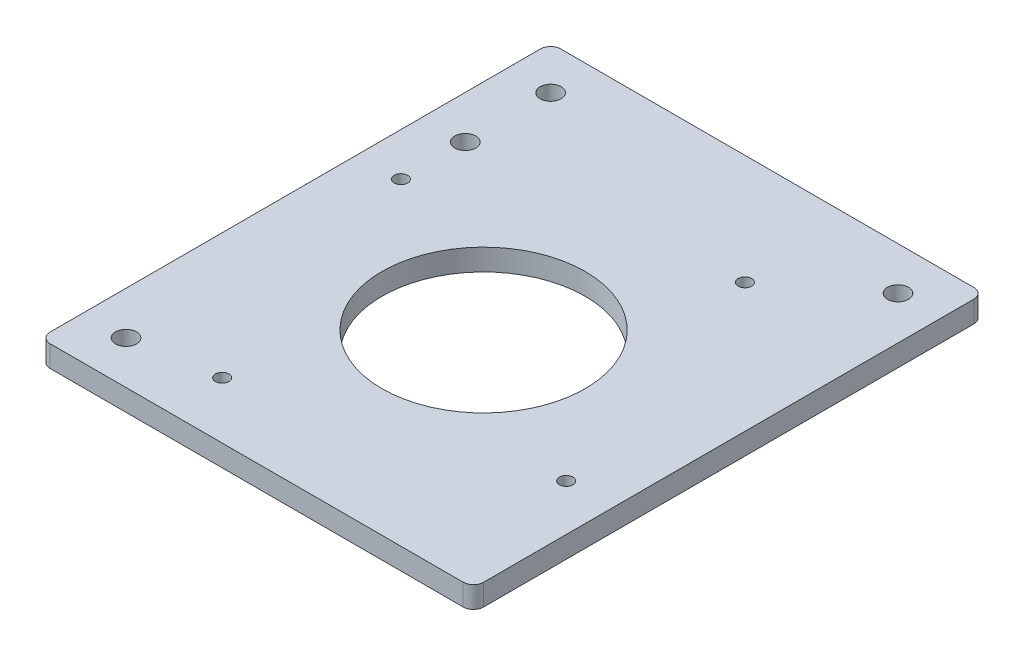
ISO-10303-21;
HEADER;
FILE_DESCRIPTION(('STEP AP214'),'2;1');
FILE_NAME('part.step','',(''),(''),'','','');
FILE_SCHEMA(('AUTOMOTIVE_DESIGN { 1 0 10303 214 1 1 1 1 }'));
ENDSEC;
DATA;
#1=APPLICATION_CONTEXT('core data for automotive mechanical design processes');
#2=APPLICATION_PROTOCOL_DEFINITION('international standard','automotive_design',2000,#1);
#3=PRODUCT_CONTEXT('',#1,'mechanical');
#4=PRODUCT('Part','Part','',(#3));
#5=PRODUCT_RELATED_PRODUCT_CATEGORY('part','',(#4));
#6=PRODUCT_DEFINITION_FORMATION('','',#4);
#7=PRODUCT_DEFINITION_CONTEXT('part definition',#1,'design');
#8=PRODUCT_DEFINITION('design','',#6,#7);
#9=PRODUCT_DEFINITION_SHAPE('','',#8);
#10=(LENGTH_UNIT() NAMED_UNIT(*) SI_UNIT(.MILLI.,.METRE.));
#11=(NAMED_UNIT(*) PLANE_ANGLE_UNIT() SI_UNIT($,.RADIAN.));
#12=(NAMED_UNIT(*) SI_UNIT($,.STERADIAN.) SOLID_ANGLE_UNIT());
#13=UNCERTAINTY_MEASURE_WITH_UNIT(LENGTH_MEASURE(1.E-05),#10,'distance_accuracy_value','');
#14=(GEOMETRIC_REPRESENTATION_CONTEXT(3) GLOBAL_UNCERTAINTY_ASSIGNED_CONTEXT((#13)) GLOBAL_UNIT_ASSIGNED_CONTEXT((#10,
#11,#12)) REPRESENTATION_CONTEXT('',''));
#15=CARTESIAN_POINT('',(0.,0.,0.));
#16=DIRECTION('',(0.,0.,1.));
#17=DIRECTION('',(1.,0.,0.));
#18=AXIS2_PLACEMENT_3D('',#15,#16,#17);
#19=CARTESIAN_POINT('',(0.,6.35,0.));
#20=DIRECTION('',(0.,1.,0.));
#21=DIRECTION('',(0.,0.,1.));
#22=AXIS2_PLACEMENT_3D('',#19,#20,#21);
#23=PLANE('',#22);
#24=CARTESIAN_POINT('',(103.020909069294,6.35,502.462051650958));
#25=DIRECTION('',(0.,1.,0.));
#26=DIRECTION('',(0.,0.,1.));
#27=AXIS2_PLACEMENT_3D('',#24,#25,#26);
#28=CIRCLE('',#27,1.985);
#29=CARTESIAN_POINT('',(103.020909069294,6.35,504.447051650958));
#30=VERTEX_POINT('',#29);
#31=EDGE_CURVE('E235',#30,#30,#28,.T.);
#32=ORIENTED_EDGE('',*,*,#31,.F.);
#33=EDGE_LOOP('',(#32));
#34=FACE_BOUND('',#33,.T.);
#35=CARTESIAN_POINT('',(127.427334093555,6.35,579.6556266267));
#36=DIRECTION('',(0.,1.,0.));
#37=DIRECTION('',(0.,0.,1.));
#38=AXIS2_PLACEMENT_3D('',#35,#36,#37);
#39=CIRCLE('',#38,1.985);
#40=CARTESIAN_POINT('',(127.427334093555,6.35,581.6406266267));
#41=VERTEX_POINT('',#40);
#42=EDGE_CURVE('E232',#41,#41,#39,.T.);
#43=ORIENTED_EDGE('',*,*,#42,.F.);
#44=EDGE_LOOP('',(#43));
#45=FACE_BOUND('',#44,.T.);
#46=CARTESIAN_POINT('',(50.2337591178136,6.35,604.06205165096));
#47=DIRECTION('',(0.,1.,0.));
#48=DIRECTION('',(0.,0.,1.));
#49=AXIS2_PLACEMENT_3D('',#46,#47,#48);
#50=CIRCLE('',#49,1.98500000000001);
#51=CARTESIAN_POINT('',(50.2337591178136,6.35,606.04705165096));
#52=VERTEX_POINT('',#51);
#53=EDGE_CURVE('E226',#52,#52,#50,.T.);
#54=ORIENTED_EDGE('',*,*,#53,.F.);
#55=EDGE_LOOP('',(#54));
#56=FACE_BOUND('',#55,.T.);
#57=CARTESIAN_POINT('',(25.8273340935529,6.35,526.868476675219));
#58=DIRECTION('',(0.,1.,0.));
#59=DIRECTION('',(0.,0.,1.));
#60=AXIS2_PLACEMENT_3D('',#57,#58,#59);
#61=CIRCLE('',#60,1.98500000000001);
#62=CARTESIAN_POINT('',(25.8273340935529,6.35,528.853476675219));
#63=VERTEX_POINT('',#62);
#64=EDGE_CURVE('E220',#63,#63,#61,.T.);
#65=ORIENTED_EDGE('',*,*,#64,.F.);
#66=EDGE_LOOP('',(#65));
#67=FACE_BOUND('',#66,.T.);
#68=CARTESIAN_POINT('',(25.8273340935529,6.35,608.062051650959));
#69=DIRECTION('',(0.,1.,0.));
#70=DIRECTION('',(0.,0.,1.));
#71=AXIS2_PLACEMENT_3D('',#68,#69,#70);
#72=CIRCLE('',#71,3.10000000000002);
#73=CARTESIAN_POINT('',(25.8273340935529,6.35,611.162051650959));
#74=VERTEX_POINT('',#73);
#75=EDGE_CURVE('E202',#74,#74,#72,.T.);
#76=ORIENTED_EDGE('',*,*,#75,.F.);
#77=EDGE_LOOP('',(#76));
#78=FACE_BOUND('',#77,.T.);
#79=CARTESIAN_POINT('',(25.8273340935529,6.35,482.662051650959));
#80=DIRECTION('',(0.,1.,0.));
#81=DIRECTION('',(0.,0.,1.));
#82=AXIS2_PLACEMENT_3D('',#79,#80,#81);
#83=CIRCLE('',#82,3.1);
#84=CARTESIAN_POINT('',(25.8273340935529,6.35,485.762051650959));
#85=VERTEX_POINT('',#84);
#86=EDGE_CURVE('E190',#85,#85,#83,.T.);
#87=ORIENTED_EDGE('',*,*,#86,.F.);
#88=EDGE_LOOP('',(#87));
#89=FACE_BOUND('',#88,.T.);
#90=DIRECTION('',(0.,0.,-1.));
#91=VECTOR('',#90,1.);
#92=CARTESIAN_POINT('',(141.127334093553,6.35,469.962051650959));
#93=LINE('',#92,#91);
#94=CARTESIAN_POINT('',(141.127334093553,6.35,617.762051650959));
#95=VERTEX_POINT('',#94);
#96=CARTESIAN_POINT('',(141.127334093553,6.35,472.962051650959));
#97=VERTEX_POINT('',#96);
#98=EDGE_CURVE('E147',#95,#97,#93,.T.);
#99=ORIENTED_EDGE('',*,*,#98,.T.);
#100=CARTESIAN_POINT('',(138.127334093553,6.35,472.962051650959));
#101=DIRECTION('',(0.,1.,0.));
#102=DIRECTION('',(0.,0.,1.));
#103=AXIS2_PLACEMENT_3D('',#100,#101,#102);
#104=CIRCLE('',#103,3.);
#105=CARTESIAN_POINT('',(138.127334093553,6.35,469.962051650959));
#106=VERTEX_POINT('',#105);
#107=EDGE_CURVE('E162',#97,#106,#104,.T.);
#108=ORIENTED_EDGE('',*,*,#107,.T.);
#109=DIRECTION('',(-1.,0.,0.));
#110=VECTOR('',#109,1.);
#111=CARTESIAN_POINT('',(13.127334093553,6.35,469.962051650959));
#112=LINE('',#111,#110);
#113=CARTESIAN_POINT('',(16.127334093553,6.35,469.962051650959));
#114=VERTEX_POINT('',#113);
#115=EDGE_CURVE('E129',#106,#114,#112,.T.);
#116=ORIENTED_EDGE('',*,*,#115,.T.);
#117=CARTESIAN_POINT('',(16.127334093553,6.35,472.962051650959));
#118=DIRECTION('',(0.,1.,0.));
#119=DIRECTION('',(0.,0.,1.));
#120=AXIS2_PLACEMENT_3D('',#117,#118,#119);
#121=CIRCLE('',#120,3.);
#122=CARTESIAN_POINT('',(13.127334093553,6.35,472.962051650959));
#123=VERTEX_POINT('',#122);
#124=EDGE_CURVE('E157',#114,#123,#121,.T.);
#125=ORIENTED_EDGE('',*,*,#124,.T.);
#126=DIRECTION('',(0.,0.,1.));
#127=VECTOR('',#126,1.);
#128=CARTESIAN_POINT('',(13.127334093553,6.35,469.962051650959));
#129=LINE('',#128,#127);
#130=CARTESIAN_POINT('',(13.127334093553,6.35,617.762051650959));
#131=VERTEX_POINT('',#130);
#132=EDGE_CURVE('E173',#123,#131,#129,.T.);
#133=ORIENTED_EDGE('',*,*,#132,.T.);
#134=CARTESIAN_POINT('',(16.127334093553,6.35,617.762051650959));
#135=DIRECTION('',(0.,1.,0.));
#136=DIRECTION('',(0.,0.,1.));
#137=AXIS2_PLACEMENT_3D('',#134,#135,#136);
#138=CIRCLE('',#137,3.);
#139=CARTESIAN_POINT('',(16.127334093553,6.35,620.762051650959));
#140=VERTEX_POINT('',#139);
#141=EDGE_CURVE('E65',#131,#140,#138,.T.);
#142=ORIENTED_EDGE('',*,*,#141,.T.);
#143=DIRECTION('',(1.,0.,0.));
#144=VECTOR('',#143,1.);
#145=CARTESIAN_POINT('',(13.127334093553,6.35,620.762051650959));
#146=LINE('',#145,#144);
#147=CARTESIAN_POINT('',(138.127334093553,6.35,620.762051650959));
#148=VERTEX_POINT('',#147);
#149=EDGE_CURVE('E148',#140,#148,#146,.T.);
#150=ORIENTED_EDGE('',*,*,#149,.T.);
#151=CARTESIAN_POINT('',(138.127334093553,6.35,617.762051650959));
#152=DIRECTION('',(0.,1.,0.));
#153=DIRECTION('',(0.,0.,1.));
#154=AXIS2_PLACEMENT_3D('',#151,#152,#153);
#155=CIRCLE('',#154,3.);
#156=EDGE_CURVE('E160',#148,#95,#155,.T.);
#157=ORIENTED_EDGE('',*,*,#156,.T.);
#158=EDGE_LOOP('',(#99,#108,#116,#125,#133,#142,#150,#157));
#159=FACE_BOUND('',#158,.T.);
#160=CARTESIAN_POINT('',(76.6273340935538,6.35,553.262051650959));
#161=DIRECTION('',(0.,1.,0.));
#162=DIRECTION('',(0.,0.,1.));
#163=AXIS2_PLACEMENT_3D('',#160,#161,#162);
#164=CIRCLE('',#163,30.);
#165=CARTESIAN_POINT('',(76.6273340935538,6.35,583.262051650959));
#166=VERTEX_POINT('',#165);
#167=EDGE_CURVE('E142',#166,#166,#164,.T.);
#168=ORIENTED_EDGE('',*,*,#167,.F.);
#169=EDGE_LOOP('',(#168));
#170=FACE_BOUND('',#169,.T.);
#171=CARTESIAN_POINT('',(128.427334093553,6.35,482.662051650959));
#172=DIRECTION('',(0.,1.,0.));
#173=DIRECTION('',(0.,0.,1.));
#174=AXIS2_PLACEMENT_3D('',#171,#172,#173);
#175=CIRCLE('',#174,3.09999999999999);
#176=CARTESIAN_POINT('',(128.427334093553,6.35,485.762051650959));
#177=VERTEX_POINT('',#176);
#178=EDGE_CURVE('E196',#177,#177,#175,.T.);
#179=ORIENTED_EDGE('',*,*,#178,.F.);
#180=EDGE_LOOP('',(#179));
#181=FACE_BOUND('',#180,.T.);
#182=CARTESIAN_POINT('',(25.8273340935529,6.35,507.862051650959));
#183=DIRECTION('',(0.,1.,0.));
#184=DIRECTION('',(0.,0.,1.));
#185=AXIS2_PLACEMENT_3D('',#182,#183,#184);
#186=CIRCLE('',#185,3.1);
#187=CARTESIAN_POINT('',(25.8273340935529,6.35,510.962051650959));
#188=VERTEX_POINT('',#187);
#189=EDGE_CURVE('E208',#188,#188,#186,.T.);
#190=ORIENTED_EDGE('',*,*,#189,.F.);
#191=EDGE_LOOP('',(#190));
#192=FACE_BOUND('',#191,.T.);
#193=ADVANCED_FACE('F43',(#34,#45,#56,#67,#78,#89,#159,#170,#181,#192),#23,.T.);
#194=CARTESIAN_POINT('',(0.,0.,0.));
#195=DIRECTION('',(0.,1.,0.));
#196=DIRECTION('',(0.,0.,1.));
#197=AXIS2_PLACEMENT_3D('',#194,#195,#196);
#198=PLANE('',#197);
#199=CARTESIAN_POINT('',(103.020909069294,0.,502.462051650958));
#200=DIRECTION('',(0.,1.,0.));
#201=DIRECTION('',(0.,0.,1.));
#202=AXIS2_PLACEMENT_3D('',#199,#200,#201);
#203=CIRCLE('',#202,1.985);
#204=CARTESIAN_POINT('',(103.020909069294,0.,504.447051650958));
#205=VERTEX_POINT('',#204);
#206=EDGE_CURVE('E214',#205,#205,#203,.T.);
#207=ORIENTED_EDGE('',*,*,#206,.T.);
#208=EDGE_LOOP('',(#207));
#209=FACE_BOUND('',#208,.T.);
#210=CARTESIAN_POINT('',(127.427334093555,0.,579.6556266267));
#211=DIRECTION('',(0.,1.,0.));
#212=DIRECTION('',(0.,0.,1.));
#213=AXIS2_PLACEMENT_3D('',#210,#211,#212);
#214=CIRCLE('',#213,1.985);
#215=CARTESIAN_POINT('',(127.427334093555,0.,581.6406266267));
#216=VERTEX_POINT('',#215);
#217=EDGE_CURVE('E229',#216,#216,#214,.T.);
#218=ORIENTED_EDGE('',*,*,#217,.T.);
#219=EDGE_LOOP('',(#218));
#220=FACE_BOUND('',#219,.T.);
#221=CARTESIAN_POINT('',(50.2337591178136,0.,604.06205165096));
#222=DIRECTION('',(0.,1.,0.));
#223=DIRECTION('',(0.,0.,1.));
#224=AXIS2_PLACEMENT_3D('',#221,#222,#223);
#225=CIRCLE('',#224,1.98500000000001);
#226=CARTESIAN_POINT('',(50.2337591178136,0.,606.04705165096));
#227=VERTEX_POINT('',#226);
#228=EDGE_CURVE('E223',#227,#227,#225,.T.);
#229=ORIENTED_EDGE('',*,*,#228,.T.);
#230=EDGE_LOOP('',(#229));
#231=FACE_BOUND('',#230,.T.);
#232=CARTESIAN_POINT('',(25.8273340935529,0.,526.868476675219));
#233=DIRECTION('',(0.,1.,0.));
#234=DIRECTION('',(0.,0.,1.));
#235=AXIS2_PLACEMENT_3D('',#232,#233,#234);
#236=CIRCLE('',#235,1.98500000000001);
#237=CARTESIAN_POINT('',(25.8273340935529,0.,528.853476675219));
#238=VERTEX_POINT('',#237);
#239=EDGE_CURVE('E217',#238,#238,#236,.T.);
#240=ORIENTED_EDGE('',*,*,#239,.T.);
#241=EDGE_LOOP('',(#240));
#242=FACE_BOUND('',#241,.T.);
#243=DIRECTION('',(-1.,0.,0.));
#244=VECTOR('',#243,1.);
#245=CARTESIAN_POINT('',(13.127334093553,0.,469.962051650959));
#246=LINE('',#245,#244);
#247=CARTESIAN_POINT('',(138.127334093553,0.,469.962051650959));
#248=VERTEX_POINT('',#247);
#249=CARTESIAN_POINT('',(16.127334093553,0.,469.962051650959));
#250=VERTEX_POINT('',#249);
#251=EDGE_CURVE('E126',#248,#250,#246,.T.);
#252=ORIENTED_EDGE('',*,*,#251,.F.);
#253=CARTESIAN_POINT('',(138.127334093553,0.,472.962051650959));
#254=DIRECTION('',(0.,1.,0.));
#255=DIRECTION('',(0.,0.,1.));
#256=AXIS2_PLACEMENT_3D('',#253,#254,#255);
#257=CIRCLE('',#256,3.);
#258=CARTESIAN_POINT('',(141.127334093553,0.,472.962051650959));
#259=VERTEX_POINT('',#258);
#260=EDGE_CURVE('E109',#248,#259,#257,.F.);
#261=ORIENTED_EDGE('',*,*,#260,.T.);
#262=DIRECTION('',(0.,0.,-1.));
#263=VECTOR('',#262,1.);
#264=CARTESIAN_POINT('',(141.127334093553,0.,469.962051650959));
#265=LINE('',#264,#263);
#266=CARTESIAN_POINT('',(141.127334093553,0.,617.762051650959));
#267=VERTEX_POINT('',#266);
#268=EDGE_CURVE('E137',#267,#259,#265,.T.);
#269=ORIENTED_EDGE('',*,*,#268,.F.);
#270=CARTESIAN_POINT('',(138.127334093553,0.,617.762051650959));
#271=DIRECTION('',(0.,1.,0.));
#272=DIRECTION('',(0.,0.,1.));
#273=AXIS2_PLACEMENT_3D('',#270,#271,#272);
#274=CIRCLE('',#273,3.);
#275=CARTESIAN_POINT('',(138.127334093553,0.,620.762051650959));
#276=VERTEX_POINT('',#275);
#277=EDGE_CURVE('E120',#267,#276,#274,.F.);
#278=ORIENTED_EDGE('',*,*,#277,.T.);
#279=DIRECTION('',(1.,0.,0.));
#280=VECTOR('',#279,1.);
#281=CARTESIAN_POINT('',(13.127334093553,0.,620.762051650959));
#282=LINE('',#281,#280);
#283=CARTESIAN_POINT('',(16.127334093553,0.,620.762051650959));
#284=VERTEX_POINT('',#283);
#285=EDGE_CURVE('E140',#284,#276,#282,.T.);
#286=ORIENTED_EDGE('',*,*,#285,.F.);
#287=CARTESIAN_POINT('',(16.127334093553,0.,617.762051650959));
#288=DIRECTION('',(0.,1.,0.));
#289=DIRECTION('',(0.,0.,1.));
#290=AXIS2_PLACEMENT_3D('',#287,#288,#289);
#291=CIRCLE('',#290,3.);
#292=CARTESIAN_POINT('',(13.127334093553,0.,617.762051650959));
#293=VERTEX_POINT('',#292);
#294=EDGE_CURVE('E151',#284,#293,#291,.F.);
#295=ORIENTED_EDGE('',*,*,#294,.T.);
#296=DIRECTION('',(0.,0.,1.));
#297=VECTOR('',#296,1.);
#298=CARTESIAN_POINT('',(13.127334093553,0.,469.962051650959));
#299=LINE('',#298,#297);
#300=CARTESIAN_POINT('',(13.127334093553,0.,472.962051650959));
#301=VERTEX_POINT('',#300);
#302=EDGE_CURVE('E136',#301,#293,#299,.T.);
#303=ORIENTED_EDGE('',*,*,#302,.F.);
#304=CARTESIAN_POINT('',(16.127334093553,0.,472.962051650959));
#305=DIRECTION('',(0.,1.,0.));
#306=DIRECTION('',(0.,0.,1.));
#307=AXIS2_PLACEMENT_3D('',#304,#305,#306);
#308=CIRCLE('',#307,3.);
#309=EDGE_CURVE('E130',#301,#250,#308,.F.);
#310=ORIENTED_EDGE('',*,*,#309,.T.);
#311=EDGE_LOOP('',(#252,#261,#269,#278,#286,#295,#303,#310));
#312=FACE_BOUND('',#311,.T.);
#313=CARTESIAN_POINT('',(76.6273340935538,0.,553.262051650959));
#314=DIRECTION('',(0.,1.,0.));
#315=DIRECTION('',(0.,0.,1.));
#316=AXIS2_PLACEMENT_3D('',#313,#314,#315);
#317=CIRCLE('',#316,30.);
#318=CARTESIAN_POINT('',(76.6273340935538,0.,583.262051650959));
#319=VERTEX_POINT('',#318);
#320=EDGE_CURVE('E187',#319,#319,#317,.T.);
#321=ORIENTED_EDGE('',*,*,#320,.T.);
#322=EDGE_LOOP('',(#321));
#323=FACE_BOUND('',#322,.T.);
#324=CARTESIAN_POINT('',(25.8273340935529,0.,482.662051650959));
#325=DIRECTION('',(0.,1.,0.));
#326=DIRECTION('',(0.,0.,1.));
#327=AXIS2_PLACEMENT_3D('',#324,#325,#326);
#328=CIRCLE('',#327,3.1);
#329=CARTESIAN_POINT('',(25.8273340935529,0.,485.762051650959));
#330=VERTEX_POINT('',#329);
#331=EDGE_CURVE('E193',#330,#330,#328,.T.);
#332=ORIENTED_EDGE('',*,*,#331,.T.);
#333=EDGE_LOOP('',(#332));
#334=FACE_BOUND('',#333,.T.);
#335=CARTESIAN_POINT('',(128.427334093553,0.,482.662051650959));
#336=DIRECTION('',(0.,1.,0.));
#337=DIRECTION('',(0.,0.,1.));
#338=AXIS2_PLACEMENT_3D('',#335,#336,#337);
#339=CIRCLE('',#338,3.09999999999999);
#340=CARTESIAN_POINT('',(128.427334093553,0.,485.762051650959));
#341=VERTEX_POINT('',#340);
#342=EDGE_CURVE('E199',#341,#341,#339,.T.);
#343=ORIENTED_EDGE('',*,*,#342,.T.);
#344=EDGE_LOOP('',(#343));
#345=FACE_BOUND('',#344,.T.);
#346=CARTESIAN_POINT('',(25.8273340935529,0.,608.062051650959));
#347=DIRECTION('',(0.,1.,0.));
#348=DIRECTION('',(0.,0.,1.));
#349=AXIS2_PLACEMENT_3D('',#346,#347,#348);
#350=CIRCLE('',#349,3.10000000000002);
#351=CARTESIAN_POINT('',(25.8273340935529,0.,611.162051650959));
#352=VERTEX_POINT('',#351);
#353=EDGE_CURVE('E205',#352,#352,#350,.T.);
#354=ORIENTED_EDGE('',*,*,#353,.T.);
#355=EDGE_LOOP('',(#354));
#356=FACE_BOUND('',#355,.T.);
#357=CARTESIAN_POINT('',(25.8273340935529,0.,507.862051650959));
#358=DIRECTION('',(0.,1.,0.));
#359=DIRECTION('',(0.,0.,1.));
#360=AXIS2_PLACEMENT_3D('',#357,#358,#359);
#361=CIRCLE('',#360,3.1);
#362=CARTESIAN_POINT('',(25.8273340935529,0.,510.962051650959));
#363=VERTEX_POINT('',#362);
#364=EDGE_CURVE('E211',#363,#363,#361,.T.);
#365=ORIENTED_EDGE('',*,*,#364,.T.);
#366=EDGE_LOOP('',(#365));
#367=FACE_BOUND('',#366,.T.);
#368=ADVANCED_FACE('F133',(#209,#220,#231,#242,#312,#323,#334,#345,#356,#367),#198,.F.);
#369=CARTESIAN_POINT('',(141.127334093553,6.35,469.962051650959));
#370=DIRECTION('',(-1.,0.,0.));
#371=DIRECTION('',(0.,0.,1.));
#372=AXIS2_PLACEMENT_3D('',#369,#370,#371);
#373=PLANE('',#372);
#374=ORIENTED_EDGE('',*,*,#268,.T.);
#375=DIRECTION('',(0.,-1.,0.));
#376=VECTOR('',#375,1.);
#377=CARTESIAN_POINT('',(141.127334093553,6.35,472.962051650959));
#378=LINE('',#377,#376);
#379=EDGE_CURVE('E114',#259,#97,#378,.F.);
#380=ORIENTED_EDGE('',*,*,#379,.T.);
#381=ORIENTED_EDGE('',*,*,#98,.F.);
#382=DIRECTION('',(0.,-1.,0.));
#383=VECTOR('',#382,1.);
#384=CARTESIAN_POINT('',(141.127334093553,6.35,617.762051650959));
#385=LINE('',#384,#383);
#386=EDGE_CURVE('E119',#95,#267,#385,.T.);
#387=ORIENTED_EDGE('',*,*,#386,.T.);
#388=EDGE_LOOP('',(#374,#380,#381,#387));
#389=FACE_BOUND('',#388,.T.);
#390=ADVANCED_FACE('F278',(#389),#373,.F.);
#391=CARTESIAN_POINT('',(13.127334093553,6.35,469.962051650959));
#392=DIRECTION('',(0.,0.,1.));
#393=DIRECTION('',(1.,0.,0.));
#394=AXIS2_PLACEMENT_3D('',#391,#392,#393);
#395=PLANE('',#394);
#396=ORIENTED_EDGE('',*,*,#115,.F.);
#397=DIRECTION('',(0.,-1.,0.));
#398=VECTOR('',#397,1.);
#399=CARTESIAN_POINT('',(138.127334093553,6.35,469.962051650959));
#400=LINE('',#399,#398);
#401=EDGE_CURVE('E113',#106,#248,#400,.T.);
#402=ORIENTED_EDGE('',*,*,#401,.T.);
#403=ORIENTED_EDGE('',*,*,#251,.T.);
#404=DIRECTION('',(0.,-1.,0.));
#405=VECTOR('',#404,1.);
#406=CARTESIAN_POINT('',(16.127334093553,6.35,469.962051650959));
#407=LINE('',#406,#405);
#408=EDGE_CURVE('E131',#250,#114,#407,.F.);
#409=ORIENTED_EDGE('',*,*,#408,.T.);
#410=EDGE_LOOP('',(#396,#402,#403,#409));
#411=FACE_BOUND('',#410,.T.);
#412=ADVANCED_FACE('F125',(#411),#395,.F.);
#413=CARTESIAN_POINT('',(13.127334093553,6.35,469.962051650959));
#414=DIRECTION('',(1.,0.,0.));
#415=DIRECTION('',(0.,0.,-1.));
#416=AXIS2_PLACEMENT_3D('',#413,#414,#415);
#417=PLANE('',#416);
#418=ORIENTED_EDGE('',*,*,#302,.T.);
#419=DIRECTION('',(0.,-1.,0.));
#420=VECTOR('',#419,1.);
#421=CARTESIAN_POINT('',(13.127334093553,6.35,617.762051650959));
#422=LINE('',#421,#420);
#423=EDGE_CURVE('E11',#293,#131,#422,.F.);
#424=ORIENTED_EDGE('',*,*,#423,.T.);
#425=ORIENTED_EDGE('',*,*,#132,.F.);
#426=DIRECTION('',(0.,-1.,0.));
#427=VECTOR('',#426,1.);
#428=CARTESIAN_POINT('',(13.127334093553,6.35,472.962051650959));
#429=LINE('',#428,#427);
#430=EDGE_CURVE('E51',#123,#301,#429,.T.);
#431=ORIENTED_EDGE('',*,*,#430,.T.);
#432=EDGE_LOOP('',(#418,#424,#425,#431));
#433=FACE_BOUND('',#432,.T.);
#434=ADVANCED_FACE('F171',(#433),#417,.F.);
#435=CARTESIAN_POINT('',(13.127334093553,6.35,620.762051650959));
#436=DIRECTION('',(0.,0.,-1.));
#437=DIRECTION('',(-1.,0.,0.));
#438=AXIS2_PLACEMENT_3D('',#435,#436,#437);
#439=PLANE('',#438);
#440=ORIENTED_EDGE('',*,*,#285,.T.);
#441=DIRECTION('',(0.,-1.,0.));
#442=VECTOR('',#441,1.);
#443=CARTESIAN_POINT('',(138.127334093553,6.35,620.762051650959));
#444=LINE('',#443,#442);
#445=EDGE_CURVE('E58',#276,#148,#444,.F.);
#446=ORIENTED_EDGE('',*,*,#445,.T.);
#447=ORIENTED_EDGE('',*,*,#149,.F.);
#448=DIRECTION('',(0.,-1.,0.));
#449=VECTOR('',#448,1.);
#450=CARTESIAN_POINT('',(16.127334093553,6.35,620.762051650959));
#451=LINE('',#450,#449);
#452=EDGE_CURVE('E164',#140,#284,#451,.T.);
#453=ORIENTED_EDGE('',*,*,#452,.T.);
#454=EDGE_LOOP('',(#440,#446,#447,#453));
#455=FACE_BOUND('',#454,.T.);
#456=ADVANCED_FACE('F180',(#455),#439,.F.);
#457=CARTESIAN_POINT('',(76.6273340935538,6.35,553.262051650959));
#458=DIRECTION('',(0.,-1.,0.));
#459=DIRECTION('',(0.,0.,-1.));
#460=AXIS2_PLACEMENT_3D('',#457,#458,#459);
#461=CYLINDRICAL_SURFACE('',#460,30.);
#462=ORIENTED_EDGE('',*,*,#167,.T.);
#463=EDGE_LOOP('',(#462));
#464=FACE_BOUND('',#463,.T.);
#465=ORIENTED_EDGE('',*,*,#320,.F.);
#466=EDGE_LOOP('',(#465));
#467=FACE_BOUND('',#466,.T.);
#468=ADVANCED_FACE('F290',(#464,#467),#461,.F.);
#469=CARTESIAN_POINT('',(25.8273340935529,6.35,482.662051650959));
#470=DIRECTION('',(0.,-1.,0.));
#471=DIRECTION('',(0.,0.,-1.));
#472=AXIS2_PLACEMENT_3D('',#469,#470,#471);
#473=CYLINDRICAL_SURFACE('',#472,3.1);
#474=ORIENTED_EDGE('',*,*,#86,.T.);
#475=EDGE_LOOP('',(#474));
#476=FACE_BOUND('',#475,.T.);
#477=ORIENTED_EDGE('',*,*,#331,.F.);
#478=EDGE_LOOP('',(#477));
#479=FACE_BOUND('',#478,.T.);
#480=ADVANCED_FACE('F325',(#476,#479),#473,.F.);
#481=CARTESIAN_POINT('',(128.427334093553,6.35,482.662051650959));
#482=DIRECTION('',(0.,-1.,0.));
#483=DIRECTION('',(0.,0.,-1.));
#484=AXIS2_PLACEMENT_3D('',#481,#482,#483);
#485=CYLINDRICAL_SURFACE('',#484,3.09999999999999);
#486=ORIENTED_EDGE('',*,*,#178,.T.);
#487=EDGE_LOOP('',(#486));
#488=FACE_BOUND('',#487,.T.);
#489=ORIENTED_EDGE('',*,*,#342,.F.);
#490=EDGE_LOOP('',(#489));
#491=FACE_BOUND('',#490,.T.);
#492=ADVANCED_FACE('F321',(#488,#491),#485,.F.);
#493=CARTESIAN_POINT('',(25.8273340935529,6.35,608.062051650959));
#494=DIRECTION('',(0.,-1.,0.));
#495=DIRECTION('',(0.,0.,-1.));
#496=AXIS2_PLACEMENT_3D('',#493,#494,#495);
#497=CYLINDRICAL_SURFACE('',#496,3.10000000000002);
#498=ORIENTED_EDGE('',*,*,#75,.T.);
#499=EDGE_LOOP('',(#498));
#500=FACE_BOUND('',#499,.T.);
#501=ORIENTED_EDGE('',*,*,#353,.F.);
#502=EDGE_LOOP('',(#501));
#503=FACE_BOUND('',#502,.T.);
#504=ADVANCED_FACE('F273',(#500,#503),#497,.F.);
#505=CARTESIAN_POINT('',(25.8273340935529,6.35,507.862051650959));
#506=DIRECTION('',(0.,-1.,0.));
#507=DIRECTION('',(0.,0.,-1.));
#508=AXIS2_PLACEMENT_3D('',#505,#506,#507);
#509=CYLINDRICAL_SURFACE('',#508,3.1);
#510=ORIENTED_EDGE('',*,*,#189,.T.);
#511=EDGE_LOOP('',(#510));
#512=FACE_BOUND('',#511,.T.);
#513=ORIENTED_EDGE('',*,*,#364,.F.);
#514=EDGE_LOOP('',(#513));
#515=FACE_BOUND('',#514,.T.);
#516=ADVANCED_FACE('F270',(#512,#515),#509,.F.);
#517=CARTESIAN_POINT('',(138.127334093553,6.35,472.962051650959));
#518=DIRECTION('',(0.,-1.,0.));
#519=DIRECTION('',(0.,0.,-1.));
#520=AXIS2_PLACEMENT_3D('',#517,#518,#519);
#521=CYLINDRICAL_SURFACE('',#520,3.);
#522=ORIENTED_EDGE('',*,*,#107,.F.);
#523=ORIENTED_EDGE('',*,*,#379,.F.);
#524=ORIENTED_EDGE('',*,*,#260,.F.);
#525=ORIENTED_EDGE('',*,*,#401,.F.);
#526=EDGE_LOOP('',(#522,#523,#524,#525));
#527=FACE_BOUND('',#526,.T.);
#528=ADVANCED_FACE('F112',(#527),#521,.T.);
#529=CARTESIAN_POINT('',(138.127334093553,6.35,617.762051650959));
#530=DIRECTION('',(0.,-1.,0.));
#531=DIRECTION('',(0.,0.,-1.));
#532=AXIS2_PLACEMENT_3D('',#529,#530,#531);
#533=CYLINDRICAL_SURFACE('',#532,3.);
#534=ORIENTED_EDGE('',*,*,#156,.F.);
#535=ORIENTED_EDGE('',*,*,#445,.F.);
#536=ORIENTED_EDGE('',*,*,#277,.F.);
#537=ORIENTED_EDGE('',*,*,#386,.F.);
#538=EDGE_LOOP('',(#534,#535,#536,#537));
#539=FACE_BOUND('',#538,.T.);
#540=ADVANCED_FACE('F297',(#539),#533,.T.);
#541=CARTESIAN_POINT('',(16.127334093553,6.35,617.762051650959));
#542=DIRECTION('',(0.,-1.,0.));
#543=DIRECTION('',(0.,0.,-1.));
#544=AXIS2_PLACEMENT_3D('',#541,#542,#543);
#545=CYLINDRICAL_SURFACE('',#544,3.);
#546=ORIENTED_EDGE('',*,*,#141,.F.);
#547=ORIENTED_EDGE('',*,*,#423,.F.);
#548=ORIENTED_EDGE('',*,*,#294,.F.);
#549=ORIENTED_EDGE('',*,*,#452,.F.);
#550=EDGE_LOOP('',(#546,#547,#548,#549));
#551=FACE_BOUND('',#550,.T.);
#552=ADVANCED_FACE('F179',(#551),#545,.T.);
#553=CARTESIAN_POINT('',(16.127334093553,6.35,472.962051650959));
#554=DIRECTION('',(0.,-1.,0.));
#555=DIRECTION('',(0.,0.,-1.));
#556=AXIS2_PLACEMENT_3D('',#553,#554,#555);
#557=CYLINDRICAL_SURFACE('',#556,3.);
#558=ORIENTED_EDGE('',*,*,#124,.F.);
#559=ORIENTED_EDGE('',*,*,#408,.F.);
#560=ORIENTED_EDGE('',*,*,#309,.F.);
#561=ORIENTED_EDGE('',*,*,#430,.F.);
#562=EDGE_LOOP('',(#558,#559,#560,#561));
#563=FACE_BOUND('',#562,.T.);
#564=ADVANCED_FACE('F45',(#563),#557,.T.);
#565=CARTESIAN_POINT('',(25.8273340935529,0.,526.868476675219));
#566=DIRECTION('',(0.,1.,0.));
#567=DIRECTION('',(0.,0.,1.));
#568=AXIS2_PLACEMENT_3D('',#565,#566,#567);
#569=CYLINDRICAL_SURFACE('',#568,1.98500000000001);
#570=ORIENTED_EDGE('',*,*,#239,.F.);
#571=EDGE_LOOP('',(#570));
#572=FACE_BOUND('',#571,.T.);
#573=ORIENTED_EDGE('',*,*,#64,.T.);
#574=EDGE_LOOP('',(#573));
#575=FACE_BOUND('',#574,.T.);
#576=ADVANCED_FACE('F304',(#572,#575),#569,.F.);
#577=CARTESIAN_POINT('',(50.2337591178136,0.,604.06205165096));
#578=DIRECTION('',(0.,1.,0.));
#579=DIRECTION('',(0.,0.,1.));
#580=AXIS2_PLACEMENT_3D('',#577,#578,#579);
#581=CYLINDRICAL_SURFACE('',#580,1.98500000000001);
#582=ORIENTED_EDGE('',*,*,#228,.F.);
#583=EDGE_LOOP('',(#582));
#584=FACE_BOUND('',#583,.T.);
#585=ORIENTED_EDGE('',*,*,#53,.T.);
#586=EDGE_LOOP('',(#585));
#587=FACE_BOUND('',#586,.T.);
#588=ADVANCED_FACE('F307',(#584,#587),#581,.F.);
#589=CARTESIAN_POINT('',(127.427334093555,0.,579.6556266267));
#590=DIRECTION('',(0.,1.,0.));
#591=DIRECTION('',(0.,0.,1.));
#592=AXIS2_PLACEMENT_3D('',#589,#590,#591);
#593=CYLINDRICAL_SURFACE('',#592,1.985);
#594=ORIENTED_EDGE('',*,*,#217,.F.);
#595=EDGE_LOOP('',(#594));
#596=FACE_BOUND('',#595,.T.);
#597=ORIENTED_EDGE('',*,*,#42,.T.);
#598=EDGE_LOOP('',(#597));
#599=FACE_BOUND('',#598,.T.);
#600=ADVANCED_FACE('F246',(#596,#599),#593,.F.);
#601=CARTESIAN_POINT('',(103.020909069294,0.,502.462051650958));
#602=DIRECTION('',(0.,1.,0.));
#603=DIRECTION('',(0.,0.,1.));
#604=AXIS2_PLACEMENT_3D('',#601,#602,#603);
#605=CYLINDRICAL_SURFACE('',#604,1.985);
#606=ORIENTED_EDGE('',*,*,#206,.F.);
#607=EDGE_LOOP('',(#606));
#608=FACE_BOUND('',#607,.T.);
#609=ORIENTED_EDGE('',*,*,#31,.T.);
#610=EDGE_LOOP('',(#609));
#611=FACE_BOUND('',#610,.T.);
#612=ADVANCED_FACE('F243',(#608,#611),#605,.F.);
#613=CLOSED_SHELL('',(#193,#368,#390,#412,#434,#456,#468,#480,#492,#504,#516,#528,#540,#552,
#564,#576,#588,#600,#612));
#614=MANIFOLD_SOLID_BREP('B2',#613);
#615=ADVANCED_BREP_SHAPE_REPRESENTATION('',(#18,#614),#14);
#616=SHAPE_DEFINITION_REPRESENTATION(#9,#615);
ENDSEC;
END-ISO-10303-21;
